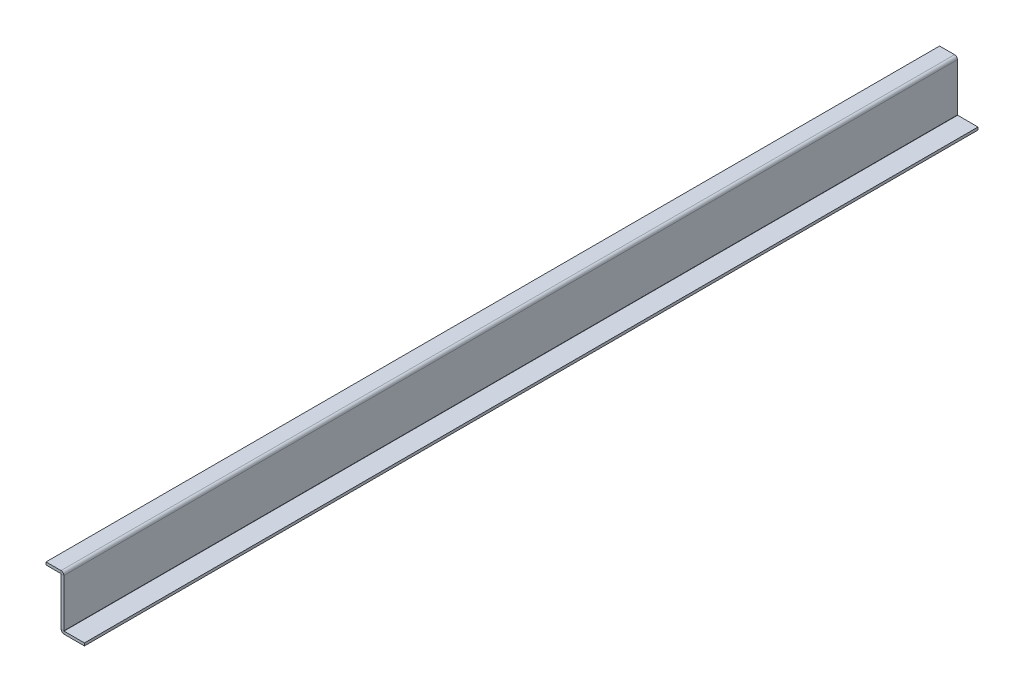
ISO-10303-21;
HEADER;
FILE_DESCRIPTION(('STEP AP214'),'2;1');
FILE_NAME('part.step','',(''),(''),'','','');
FILE_SCHEMA(('AUTOMOTIVE_DESIGN { 1 0 10303 214 1 1 1 1 }'));
ENDSEC;
DATA;
#1=APPLICATION_CONTEXT('core data for automotive mechanical design processes');
#2=APPLICATION_PROTOCOL_DEFINITION('international standard','automotive_design',2000,#1);
#3=PRODUCT_CONTEXT('',#1,'mechanical');
#4=PRODUCT('Part','Part','',(#3));
#5=PRODUCT_RELATED_PRODUCT_CATEGORY('part','',(#4));
#6=PRODUCT_DEFINITION_FORMATION('','',#4);
#7=PRODUCT_DEFINITION_CONTEXT('part definition',#1,'design');
#8=PRODUCT_DEFINITION('design','',#6,#7);
#9=PRODUCT_DEFINITION_SHAPE('','',#8);
#10=(LENGTH_UNIT() NAMED_UNIT(*) SI_UNIT(.MILLI.,.METRE.));
#11=(NAMED_UNIT(*) PLANE_ANGLE_UNIT() SI_UNIT($,.RADIAN.));
#12=(NAMED_UNIT(*) SI_UNIT($,.STERADIAN.) SOLID_ANGLE_UNIT());
#13=UNCERTAINTY_MEASURE_WITH_UNIT(LENGTH_MEASURE(1.E-05),#10,'distance_accuracy_value','');
#14=(GEOMETRIC_REPRESENTATION_CONTEXT(3) GLOBAL_UNCERTAINTY_ASSIGNED_CONTEXT((#13)) GLOBAL_UNIT_ASSIGNED_CONTEXT((#10,
#11,#12)) REPRESENTATION_CONTEXT('',''));
#15=CARTESIAN_POINT('',(0.,0.,0.));
#16=DIRECTION('',(0.,0.,1.));
#17=DIRECTION('',(1.,0.,0.));
#18=AXIS2_PLACEMENT_3D('',#15,#16,#17);
#19=CARTESIAN_POINT('',(-1.60000000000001,28.5,-500.));
#20=DIRECTION('',(0.,0.,-1.));
#21=DIRECTION('',(-1.,0.,0.));
#22=AXIS2_PLACEMENT_3D('',#19,#20,#21);
#23=PLANE('',#22);
#24=DIRECTION('',(0.,-1.,0.));
#25=VECTOR('',#24,1.);
#26=CARTESIAN_POINT('',(-1.60000000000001,28.5,-500.));
#27=LINE('',#26,#25);
#28=CARTESIAN_POINT('',(-1.60000000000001,28.5,-500.));
#29=VERTEX_POINT('',#28);
#30=CARTESIAN_POINT('',(-1.6,27.,-500.));
#31=VERTEX_POINT('',#30);
#32=EDGE_CURVE('E11',#29,#31,#27,.T.);
#33=ORIENTED_EDGE('',*,*,#32,.F.);
#34=CARTESIAN_POINT('',(-1.6,26.9,-500.));
#35=DIRECTION('',(0.,0.,1.));
#36=DIRECTION('',(1.,0.,0.));
#37=AXIS2_PLACEMENT_3D('',#34,#35,#36);
#38=CIRCLE('',#37,1.6);
#39=CARTESIAN_POINT('',(0.,26.9,-500.));
#40=VERTEX_POINT('',#39);
#41=EDGE_CURVE('E139',#29,#40,#38,.F.);
#42=ORIENTED_EDGE('',*,*,#41,.T.);
#43=DIRECTION('',(1.,0.,0.));
#44=VECTOR('',#43,1.);
#45=CARTESIAN_POINT('',(-1.5,26.9,-500.));
#46=LINE('',#45,#44);
#47=CARTESIAN_POINT('',(-1.5,26.9,-500.));
#48=VERTEX_POINT('',#47);
#49=EDGE_CURVE('E43',#48,#40,#46,.T.);
#50=ORIENTED_EDGE('',*,*,#49,.F.);
#51=CARTESIAN_POINT('',(-1.6,26.9,-500.));
#52=DIRECTION('',(0.,0.,1.));
#53=DIRECTION('',(1.,0.,0.));
#54=AXIS2_PLACEMENT_3D('',#51,#52,#53);
#55=CIRCLE('',#54,0.1);
#56=EDGE_CURVE('E136',#31,#48,#55,.F.);
#57=ORIENTED_EDGE('',*,*,#56,.F.);
#58=EDGE_LOOP('',(#33,#42,#50,#57));
#59=FACE_BOUND('',#58,.T.);
#60=ADVANCED_FACE('F35',(#59),#23,.T.);
#61=CARTESIAN_POINT('',(-1.5,26.9,-500.));
#62=DIRECTION('',(0.,0.,-1.));
#63=DIRECTION('',(-1.,0.,0.));
#64=AXIS2_PLACEMENT_3D('',#61,#62,#63);
#65=PLANE('',#64);
#66=DIRECTION('',(1.,0.,0.));
#67=VECTOR('',#66,1.);
#68=CARTESIAN_POINT('',(-10.,28.5,-500.));
#69=LINE('',#68,#67);
#70=CARTESIAN_POINT('',(-10.,28.5,-500.));
#71=VERTEX_POINT('',#70);
#72=EDGE_CURVE('E256',#71,#29,#69,.T.);
#73=ORIENTED_EDGE('',*,*,#72,.T.);
#74=ORIENTED_EDGE('',*,*,#32,.T.);
#75=DIRECTION('',(1.,0.,0.));
#76=VECTOR('',#75,1.);
#77=CARTESIAN_POINT('',(-10.,27.,-500.));
#78=LINE('',#77,#76);
#79=CARTESIAN_POINT('',(-10.,27.,-500.));
#80=VERTEX_POINT('',#79);
#81=EDGE_CURVE('E168',#80,#31,#78,.T.);
#82=ORIENTED_EDGE('',*,*,#81,.F.);
#83=DIRECTION('',(0.,1.,0.));
#84=VECTOR('',#83,1.);
#85=CARTESIAN_POINT('',(-10.,27.,-500.));
#86=LINE('',#85,#84);
#87=EDGE_CURVE('E170',#80,#71,#86,.T.);
#88=ORIENTED_EDGE('',*,*,#87,.T.);
#89=EDGE_LOOP('',(#73,#74,#82,#88));
#90=FACE_BOUND('',#89,.T.);
#91=ADVANCED_FACE('F267',(#90),#65,.T.);
#92=CARTESIAN_POINT('',(0.,26.9,0.));
#93=DIRECTION('',(0.,0.,1.));
#94=DIRECTION('',(1.,0.,0.));
#95=AXIS2_PLACEMENT_3D('',#92,#93,#94);
#96=PLANE('',#95);
#97=DIRECTION('',(-1.,0.,0.));
#98=VECTOR('',#97,1.);
#99=CARTESIAN_POINT('',(0.,26.9,0.));
#100=LINE('',#99,#98);
#101=CARTESIAN_POINT('',(0.,26.9,0.));
#102=VERTEX_POINT('',#101);
#103=CARTESIAN_POINT('',(-1.5,26.9,0.));
#104=VERTEX_POINT('',#103);
#105=EDGE_CURVE('E144',#102,#104,#100,.T.);
#106=ORIENTED_EDGE('',*,*,#105,.F.);
#107=CARTESIAN_POINT('',(-1.6,26.9,0.));
#108=DIRECTION('',(0.,0.,1.));
#109=DIRECTION('',(1.,0.,0.));
#110=AXIS2_PLACEMENT_3D('',#107,#108,#109);
#111=CIRCLE('',#110,1.6);
#112=CARTESIAN_POINT('',(-1.60000000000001,28.5,0.));
#113=VERTEX_POINT('',#112);
#114=EDGE_CURVE('E190',#113,#102,#111,.F.);
#115=ORIENTED_EDGE('',*,*,#114,.F.);
#116=DIRECTION('',(0.,1.,0.));
#117=VECTOR('',#116,1.);
#118=CARTESIAN_POINT('',(-1.6,27.,0.));
#119=LINE('',#118,#117);
#120=CARTESIAN_POINT('',(-1.6,27.,0.));
#121=VERTEX_POINT('',#120);
#122=EDGE_CURVE('E236',#121,#113,#119,.T.);
#123=ORIENTED_EDGE('',*,*,#122,.F.);
#124=CARTESIAN_POINT('',(-1.6,26.9,0.));
#125=DIRECTION('',(0.,0.,1.));
#126=DIRECTION('',(1.,0.,0.));
#127=AXIS2_PLACEMENT_3D('',#124,#125,#126);
#128=CIRCLE('',#127,0.1);
#129=EDGE_CURVE('E201',#121,#104,#128,.F.);
#130=ORIENTED_EDGE('',*,*,#129,.T.);
#131=EDGE_LOOP('',(#106,#115,#123,#130));
#132=FACE_BOUND('',#131,.T.);
#133=ADVANCED_FACE('F244',(#132),#96,.T.);
#134=CARTESIAN_POINT('',(-1.6,27.,0.));
#135=DIRECTION('',(0.,0.,1.));
#136=DIRECTION('',(1.,0.,0.));
#137=AXIS2_PLACEMENT_3D('',#134,#135,#136);
#138=PLANE('',#137);
#139=DIRECTION('',(0.,-1.,0.));
#140=VECTOR('',#139,1.);
#141=CARTESIAN_POINT('',(0.,28.5,0.));
#142=LINE('',#141,#140);
#143=CARTESIAN_POINT('',(0.,0.100000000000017,0.));
#144=VERTEX_POINT('',#143);
#145=EDGE_CURVE('E187',#102,#144,#142,.T.);
#146=ORIENTED_EDGE('',*,*,#145,.F.);
#147=ORIENTED_EDGE('',*,*,#105,.T.);
#148=DIRECTION('',(0.,-1.,0.));
#149=VECTOR('',#148,1.);
#150=CARTESIAN_POINT('',(-1.5,28.5,0.));
#151=LINE('',#150,#149);
#152=CARTESIAN_POINT('',(-1.5,0.100000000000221,0.));
#153=VERTEX_POINT('',#152);
#154=EDGE_CURVE('E153',#104,#153,#151,.T.);
#155=ORIENTED_EDGE('',*,*,#154,.T.);
#156=DIRECTION('',(1.,-1.36031232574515E-13,0.));
#157=VECTOR('',#156,1.);
#158=CARTESIAN_POINT('',(-1.5,0.100000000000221,0.));
#159=LINE('',#158,#157);
#160=EDGE_CURVE('E92',#153,#144,#159,.T.);
#161=ORIENTED_EDGE('',*,*,#160,.T.);
#162=EDGE_LOOP('',(#146,#147,#155,#161));
#163=FACE_BOUND('',#162,.T.);
#164=ADVANCED_FACE('F240',(#163),#138,.T.);
#165=CARTESIAN_POINT('',(0.,0.100000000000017,-500.));
#166=DIRECTION('',(0.,0.,-1.));
#167=DIRECTION('',(-1.,0.,0.));
#168=AXIS2_PLACEMENT_3D('',#165,#166,#167);
#169=PLANE('',#168);
#170=DIRECTION('',(-1.,1.36031232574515E-13,0.));
#171=VECTOR('',#170,1.);
#172=CARTESIAN_POINT('',(0.,0.100000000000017,-500.));
#173=LINE('',#172,#171);
#174=CARTESIAN_POINT('',(0.,0.100000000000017,-500.));
#175=VERTEX_POINT('',#174);
#176=CARTESIAN_POINT('',(-1.5,0.100000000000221,-500.));
#177=VERTEX_POINT('',#176);
#178=EDGE_CURVE('E161',#175,#177,#173,.T.);
#179=ORIENTED_EDGE('',*,*,#178,.F.);
#180=CARTESIAN_POINT('',(0.1,0.100000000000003,-500.));
#181=DIRECTION('',(0.,0.,-1.));
#182=DIRECTION('',(-1.,0.,0.));
#183=AXIS2_PLACEMENT_3D('',#180,#181,#182);
#184=CIRCLE('',#183,0.1);
#185=CARTESIAN_POINT('',(0.1,0.,-500.));
#186=VERTEX_POINT('',#185);
#187=EDGE_CURVE('E254',#175,#186,#184,.F.);
#188=ORIENTED_EDGE('',*,*,#187,.T.);
#189=DIRECTION('',(0.,1.,0.));
#190=VECTOR('',#189,1.);
#191=CARTESIAN_POINT('',(0.1,-1.5,-500.));
#192=LINE('',#191,#190);
#193=CARTESIAN_POINT('',(0.1,-1.5,-500.));
#194=VERTEX_POINT('',#193);
#195=EDGE_CURVE('E51',#194,#186,#192,.T.);
#196=ORIENTED_EDGE('',*,*,#195,.F.);
#197=CARTESIAN_POINT('',(0.1,0.100000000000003,-500.));
#198=DIRECTION('',(0.,0.,1.));
#199=DIRECTION('',(1.,0.,0.));
#200=AXIS2_PLACEMENT_3D('',#197,#198,#199);
#201=CIRCLE('',#200,1.6);
#202=EDGE_CURVE('E163',#177,#194,#201,.T.);
#203=ORIENTED_EDGE('',*,*,#202,.F.);
#204=EDGE_LOOP('',(#179,#188,#196,#203));
#205=FACE_BOUND('',#204,.T.);
#206=ADVANCED_FACE('F299',(#205),#169,.T.);
#207=CARTESIAN_POINT('',(0.1,-1.5,-500.));
#208=DIRECTION('',(0.,0.,-1.));
#209=DIRECTION('',(-1.,0.,0.));
#210=AXIS2_PLACEMENT_3D('',#207,#208,#209);
#211=PLANE('',#210);
#212=DIRECTION('',(0.,-1.,0.));
#213=VECTOR('',#212,1.);
#214=CARTESIAN_POINT('',(0.,28.5,-500.));
#215=LINE('',#214,#213);
#216=EDGE_CURVE('E252',#40,#175,#215,.T.);
#217=ORIENTED_EDGE('',*,*,#216,.T.);
#218=ORIENTED_EDGE('',*,*,#178,.T.);
#219=DIRECTION('',(0.,-1.,0.));
#220=VECTOR('',#219,1.);
#221=CARTESIAN_POINT('',(-1.5,28.5,-500.));
#222=LINE('',#221,#220);
#223=EDGE_CURVE('E151',#48,#177,#222,.T.);
#224=ORIENTED_EDGE('',*,*,#223,.F.);
#225=ORIENTED_EDGE('',*,*,#49,.T.);
#226=EDGE_LOOP('',(#217,#218,#224,#225));
#227=FACE_BOUND('',#226,.T.);
#228=ADVANCED_FACE('F160',(#227),#211,.T.);
#229=CARTESIAN_POINT('',(0.1,0.,0.));
#230=DIRECTION('',(0.,0.,1.));
#231=DIRECTION('',(1.,0.,0.));
#232=AXIS2_PLACEMENT_3D('',#229,#230,#231);
#233=PLANE('',#232);
#234=DIRECTION('',(0.,-1.,0.));
#235=VECTOR('',#234,1.);
#236=CARTESIAN_POINT('',(0.1,0.,0.));
#237=LINE('',#236,#235);
#238=CARTESIAN_POINT('',(0.1,0.,0.));
#239=VERTEX_POINT('',#238);
#240=CARTESIAN_POINT('',(0.1,-1.5,0.));
#241=VERTEX_POINT('',#240);
#242=EDGE_CURVE('E99',#239,#241,#237,.T.);
#243=ORIENTED_EDGE('',*,*,#242,.F.);
#244=CARTESIAN_POINT('',(0.1,0.100000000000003,0.));
#245=DIRECTION('',(0.,0.,-1.));
#246=DIRECTION('',(-1.,0.,0.));
#247=AXIS2_PLACEMENT_3D('',#244,#245,#246);
#248=CIRCLE('',#247,0.1);
#249=EDGE_CURVE('E184',#144,#239,#248,.F.);
#250=ORIENTED_EDGE('',*,*,#249,.F.);
#251=ORIENTED_EDGE('',*,*,#160,.F.);
#252=CARTESIAN_POINT('',(0.1,0.100000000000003,0.));
#253=DIRECTION('',(0.,0.,1.));
#254=DIRECTION('',(1.,0.,0.));
#255=AXIS2_PLACEMENT_3D('',#252,#253,#254);
#256=CIRCLE('',#255,1.6);
#257=EDGE_CURVE('E204',#153,#241,#256,.T.);
#258=ORIENTED_EDGE('',*,*,#257,.T.);
#259=EDGE_LOOP('',(#243,#250,#251,#258));
#260=FACE_BOUND('',#259,.T.);
#261=ADVANCED_FACE('F304',(#260),#233,.T.);
#262=CARTESIAN_POINT('',(-1.5,0.100000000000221,0.));
#263=DIRECTION('',(0.,0.,1.));
#264=DIRECTION('',(1.,0.,0.));
#265=AXIS2_PLACEMENT_3D('',#262,#263,#264);
#266=PLANE('',#265);
#267=DIRECTION('',(1.,0.,0.));
#268=VECTOR('',#267,1.);
#269=CARTESIAN_POINT('',(0.,0.,0.));
#270=LINE('',#269,#268);
#271=CARTESIAN_POINT('',(11.5,0.,0.));
#272=VERTEX_POINT('',#271);
#273=EDGE_CURVE('E182',#239,#272,#270,.T.);
#274=ORIENTED_EDGE('',*,*,#273,.F.);
#275=ORIENTED_EDGE('',*,*,#242,.T.);
#276=DIRECTION('',(1.,0.,0.));
#277=VECTOR('',#276,1.);
#278=CARTESIAN_POINT('',(0.,-1.5,0.));
#279=LINE('',#278,#277);
#280=CARTESIAN_POINT('',(11.5,-1.5,0.));
#281=VERTEX_POINT('',#280);
#282=EDGE_CURVE('E177',#241,#281,#279,.T.);
#283=ORIENTED_EDGE('',*,*,#282,.T.);
#284=DIRECTION('',(0.,-1.,0.));
#285=VECTOR('',#284,1.);
#286=CARTESIAN_POINT('',(11.5,0.,0.));
#287=LINE('',#286,#285);
#288=EDGE_CURVE('E179',#272,#281,#287,.T.);
#289=ORIENTED_EDGE('',*,*,#288,.F.);
#290=EDGE_LOOP('',(#274,#275,#283,#289));
#291=FACE_BOUND('',#290,.T.);
#292=ADVANCED_FACE('F307',(#291),#266,.T.);
#293=CARTESIAN_POINT('',(0.,-1.5,-500.));
#294=DIRECTION('',(0.,-1.,0.));
#295=DIRECTION('',(0.,0.,-1.));
#296=AXIS2_PLACEMENT_3D('',#293,#294,#295);
#297=PLANE('',#296);
#298=ORIENTED_EDGE('',*,*,#282,.F.);
#299=DIRECTION('',(0.,0.,1.));
#300=VECTOR('',#299,1.);
#301=CARTESIAN_POINT('',(0.1,-1.5,-500.));
#302=LINE('',#301,#300);
#303=EDGE_CURVE('E207',#194,#241,#302,.T.);
#304=ORIENTED_EDGE('',*,*,#303,.F.);
#305=DIRECTION('',(1.,0.,0.));
#306=VECTOR('',#305,1.);
#307=CARTESIAN_POINT('',(0.,-1.5,-500.));
#308=LINE('',#307,#306);
#309=CARTESIAN_POINT('',(11.5,-1.5,-500.));
#310=VERTEX_POINT('',#309);
#311=EDGE_CURVE('E206',#194,#310,#308,.T.);
#312=ORIENTED_EDGE('',*,*,#311,.T.);
#313=DIRECTION('',(0.,0.,1.));
#314=VECTOR('',#313,1.);
#315=CARTESIAN_POINT('',(11.5,-1.5,-500.));
#316=LINE('',#315,#314);
#317=EDGE_CURVE('E176',#310,#281,#316,.T.);
#318=ORIENTED_EDGE('',*,*,#317,.T.);
#319=EDGE_LOOP('',(#298,#304,#312,#318));
#320=FACE_BOUND('',#319,.T.);
#321=ADVANCED_FACE('F310',(#320),#297,.T.);
#322=CARTESIAN_POINT('',(0.1,0.100000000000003,-500.));
#323=DIRECTION('',(0.,0.,1.));
#324=DIRECTION('',(1.,0.,0.));
#325=AXIS2_PLACEMENT_3D('',#322,#323,#324);
#326=CYLINDRICAL_SURFACE('',#325,1.6);
#327=ORIENTED_EDGE('',*,*,#257,.F.);
#328=DIRECTION('',(0.,0.,1.));
#329=VECTOR('',#328,1.);
#330=CARTESIAN_POINT('',(-1.5,0.100000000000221,-500.));
#331=LINE('',#330,#329);
#332=EDGE_CURVE('E157',#177,#153,#331,.T.);
#333=ORIENTED_EDGE('',*,*,#332,.F.);
#334=ORIENTED_EDGE('',*,*,#202,.T.);
#335=ORIENTED_EDGE('',*,*,#303,.T.);
#336=EDGE_LOOP('',(#327,#333,#334,#335));
#337=FACE_BOUND('',#336,.T.);
#338=ADVANCED_FACE('F313',(#337),#326,.T.);
#339=CARTESIAN_POINT('',(-1.5,28.5,-500.));
#340=DIRECTION('',(-1.,0.,0.));
#341=DIRECTION('',(0.,-1.,0.));
#342=AXIS2_PLACEMENT_3D('',#339,#340,#341);
#343=PLANE('',#342);
#344=ORIENTED_EDGE('',*,*,#154,.F.);
#345=DIRECTION('',(0.,0.,1.));
#346=VECTOR('',#345,1.);
#347=CARTESIAN_POINT('',(-1.5,26.9,-500.));
#348=LINE('',#347,#346);
#349=EDGE_CURVE('E149',#48,#104,#348,.T.);
#350=ORIENTED_EDGE('',*,*,#349,.F.);
#351=ORIENTED_EDGE('',*,*,#223,.T.);
#352=ORIENTED_EDGE('',*,*,#332,.T.);
#353=EDGE_LOOP('',(#344,#350,#351,#352));
#354=FACE_BOUND('',#353,.T.);
#355=ADVANCED_FACE('F150',(#354),#343,.T.);
#356=CARTESIAN_POINT('',(-1.6,26.9,-500.));
#357=DIRECTION('',(0.,0.,1.));
#358=DIRECTION('',(1.,0.,0.));
#359=AXIS2_PLACEMENT_3D('',#356,#357,#358);
#360=CYLINDRICAL_SURFACE('',#359,0.1);
#361=ORIENTED_EDGE('',*,*,#129,.F.);
#362=DIRECTION('',(0.,0.,1.));
#363=VECTOR('',#362,1.);
#364=CARTESIAN_POINT('',(-1.6,27.,-500.));
#365=LINE('',#364,#363);
#366=EDGE_CURVE('E158',#31,#121,#365,.T.);
#367=ORIENTED_EDGE('',*,*,#366,.F.);
#368=ORIENTED_EDGE('',*,*,#56,.T.);
#369=ORIENTED_EDGE('',*,*,#349,.T.);
#370=EDGE_LOOP('',(#361,#367,#368,#369));
#371=FACE_BOUND('',#370,.T.);
#372=ADVANCED_FACE('F166',(#371),#360,.F.);
#373=CARTESIAN_POINT('',(-10.,27.,-500.));
#374=DIRECTION('',(0.,-1.,0.));
#375=DIRECTION('',(0.,0.,-1.));
#376=AXIS2_PLACEMENT_3D('',#373,#374,#375);
#377=PLANE('',#376);
#378=DIRECTION('',(1.,0.,0.));
#379=VECTOR('',#378,1.);
#380=CARTESIAN_POINT('',(-10.,27.,0.));
#381=LINE('',#380,#379);
#382=CARTESIAN_POINT('',(-10.,27.,0.));
#383=VERTEX_POINT('',#382);
#384=EDGE_CURVE('E198',#383,#121,#381,.T.);
#385=ORIENTED_EDGE('',*,*,#384,.F.);
#386=DIRECTION('',(0.,0.,1.));
#387=VECTOR('',#386,1.);
#388=CARTESIAN_POINT('',(-10.,27.,-500.));
#389=LINE('',#388,#387);
#390=EDGE_CURVE('E211',#80,#383,#389,.T.);
#391=ORIENTED_EDGE('',*,*,#390,.F.);
#392=ORIENTED_EDGE('',*,*,#81,.T.);
#393=ORIENTED_EDGE('',*,*,#366,.T.);
#394=EDGE_LOOP('',(#385,#391,#392,#393));
#395=FACE_BOUND('',#394,.T.);
#396=ADVANCED_FACE('F279',(#395),#377,.T.);
#397=CARTESIAN_POINT('',(-10.,27.,-500.));
#398=DIRECTION('',(1.,0.,0.));
#399=DIRECTION('',(0.,0.,-1.));
#400=AXIS2_PLACEMENT_3D('',#397,#398,#399);
#401=PLANE('',#400);
#402=DIRECTION('',(0.,1.,0.));
#403=VECTOR('',#402,1.);
#404=CARTESIAN_POINT('',(-10.,27.,0.));
#405=LINE('',#404,#403);
#406=CARTESIAN_POINT('',(-10.,28.5,0.));
#407=VERTEX_POINT('',#406);
#408=EDGE_CURVE('E196',#383,#407,#405,.T.);
#409=ORIENTED_EDGE('',*,*,#408,.T.);
#410=DIRECTION('',(0.,0.,1.));
#411=VECTOR('',#410,1.);
#412=CARTESIAN_POINT('',(-10.,28.5,-500.));
#413=LINE('',#412,#411);
#414=EDGE_CURVE('E213',#71,#407,#413,.T.);
#415=ORIENTED_EDGE('',*,*,#414,.F.);
#416=ORIENTED_EDGE('',*,*,#87,.F.);
#417=ORIENTED_EDGE('',*,*,#390,.T.);
#418=EDGE_LOOP('',(#409,#415,#416,#417));
#419=FACE_BOUND('',#418,.T.);
#420=ADVANCED_FACE('F270',(#419),#401,.F.);
#421=CARTESIAN_POINT('',(-10.,28.5,-500.));
#422=DIRECTION('',(0.,-1.,0.));
#423=DIRECTION('',(0.,0.,-1.));
#424=AXIS2_PLACEMENT_3D('',#421,#422,#423);
#425=PLANE('',#424);
#426=DIRECTION('',(1.,0.,0.));
#427=VECTOR('',#426,1.);
#428=CARTESIAN_POINT('',(-10.,28.5,0.));
#429=LINE('',#428,#427);
#430=EDGE_CURVE('E193',#407,#113,#429,.T.);
#431=ORIENTED_EDGE('',*,*,#430,.T.);
#432=DIRECTION('',(0.,0.,1.));
#433=VECTOR('',#432,1.);
#434=CARTESIAN_POINT('',(-1.60000000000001,28.5,-500.));
#435=LINE('',#434,#433);
#436=EDGE_CURVE('E216',#29,#113,#435,.T.);
#437=ORIENTED_EDGE('',*,*,#436,.F.);
#438=ORIENTED_EDGE('',*,*,#72,.F.);
#439=ORIENTED_EDGE('',*,*,#414,.T.);
#440=EDGE_LOOP('',(#431,#437,#438,#439));
#441=FACE_BOUND('',#440,.T.);
#442=ADVANCED_FACE('F274',(#441),#425,.F.);
#443=CARTESIAN_POINT('',(-1.6,26.9,-500.));
#444=DIRECTION('',(0.,0.,1.));
#445=DIRECTION('',(1.,0.,0.));
#446=AXIS2_PLACEMENT_3D('',#443,#444,#445);
#447=CYLINDRICAL_SURFACE('',#446,1.6);
#448=ORIENTED_EDGE('',*,*,#114,.T.);
#449=DIRECTION('',(0.,0.,1.));
#450=VECTOR('',#449,1.);
#451=CARTESIAN_POINT('',(0.,26.9,-500.));
#452=LINE('',#451,#450);
#453=EDGE_CURVE('E219',#40,#102,#452,.T.);
#454=ORIENTED_EDGE('',*,*,#453,.F.);
#455=ORIENTED_EDGE('',*,*,#41,.F.);
#456=ORIENTED_EDGE('',*,*,#436,.T.);
#457=EDGE_LOOP('',(#448,#454,#455,#456));
#458=FACE_BOUND('',#457,.T.);
#459=ADVANCED_FACE('F246',(#458),#447,.T.);
#460=CARTESIAN_POINT('',(0.,28.5,-500.));
#461=DIRECTION('',(-1.,0.,0.));
#462=DIRECTION('',(0.,-1.,0.));
#463=AXIS2_PLACEMENT_3D('',#460,#461,#462);
#464=PLANE('',#463);
#465=ORIENTED_EDGE('',*,*,#145,.T.);
#466=DIRECTION('',(0.,0.,1.));
#467=VECTOR('',#466,1.);
#468=CARTESIAN_POINT('',(0.,0.100000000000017,-500.));
#469=LINE('',#468,#467);
#470=EDGE_CURVE('E222',#175,#144,#469,.T.);
#471=ORIENTED_EDGE('',*,*,#470,.F.);
#472=ORIENTED_EDGE('',*,*,#216,.F.);
#473=ORIENTED_EDGE('',*,*,#453,.T.);
#474=EDGE_LOOP('',(#465,#471,#472,#473));
#475=FACE_BOUND('',#474,.T.);
#476=ADVANCED_FACE('F250',(#475),#464,.F.);
#477=CARTESIAN_POINT('',(0.1,0.100000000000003,-500.));
#478=DIRECTION('',(0.,0.,1.));
#479=DIRECTION('',(1.,0.,0.));
#480=AXIS2_PLACEMENT_3D('',#477,#478,#479);
#481=CYLINDRICAL_SURFACE('',#480,0.1);
#482=ORIENTED_EDGE('',*,*,#249,.T.);
#483=DIRECTION('',(0.,0.,1.));
#484=VECTOR('',#483,1.);
#485=CARTESIAN_POINT('',(0.1,0.,-500.));
#486=LINE('',#485,#484);
#487=EDGE_CURVE('E225',#186,#239,#486,.T.);
#488=ORIENTED_EDGE('',*,*,#487,.F.);
#489=ORIENTED_EDGE('',*,*,#187,.F.);
#490=ORIENTED_EDGE('',*,*,#470,.T.);
#491=EDGE_LOOP('',(#482,#488,#489,#490));
#492=FACE_BOUND('',#491,.T.);
#493=ADVANCED_FACE('F323',(#492),#481,.F.);
#494=CARTESIAN_POINT('',(0.,0.,-500.));
#495=DIRECTION('',(0.,-1.,0.));
#496=DIRECTION('',(0.,0.,-1.));
#497=AXIS2_PLACEMENT_3D('',#494,#495,#496);
#498=PLANE('',#497);
#499=ORIENTED_EDGE('',*,*,#273,.T.);
#500=DIRECTION('',(0.,0.,1.));
#501=VECTOR('',#500,1.);
#502=CARTESIAN_POINT('',(11.5,0.,-500.));
#503=LINE('',#502,#501);
#504=CARTESIAN_POINT('',(11.5,0.,-500.));
#505=VERTEX_POINT('',#504);
#506=EDGE_CURVE('E228',#505,#272,#503,.T.);
#507=ORIENTED_EDGE('',*,*,#506,.F.);
#508=DIRECTION('',(1.,0.,0.));
#509=VECTOR('',#508,1.);
#510=CARTESIAN_POINT('',(0.,0.,-500.));
#511=LINE('',#510,#509);
#512=EDGE_CURVE('E258',#186,#505,#511,.T.);
#513=ORIENTED_EDGE('',*,*,#512,.F.);
#514=ORIENTED_EDGE('',*,*,#487,.T.);
#515=EDGE_LOOP('',(#499,#507,#513,#514));
#516=FACE_BOUND('',#515,.T.);
#517=ADVANCED_FACE('F319',(#516),#498,.F.);
#518=CARTESIAN_POINT('',(11.5,0.,-500.));
#519=DIRECTION('',(-1.,0.,0.));
#520=DIRECTION('',(0.,0.,1.));
#521=AXIS2_PLACEMENT_3D('',#518,#519,#520);
#522=PLANE('',#521);
#523=ORIENTED_EDGE('',*,*,#288,.T.);
#524=ORIENTED_EDGE('',*,*,#317,.F.);
#525=DIRECTION('',(0.,-1.,0.));
#526=VECTOR('',#525,1.);
#527=CARTESIAN_POINT('',(11.5,0.,-500.));
#528=LINE('',#527,#526);
#529=EDGE_CURVE('E108',#505,#310,#528,.T.);
#530=ORIENTED_EDGE('',*,*,#529,.F.);
#531=ORIENTED_EDGE('',*,*,#506,.T.);
#532=EDGE_LOOP('',(#523,#524,#530,#531));
#533=FACE_BOUND('',#532,.T.);
#534=ADVANCED_FACE('F315',(#533),#522,.F.);
#535=CARTESIAN_POINT('',(0.1,0.100000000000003,-500.));
#536=DIRECTION('',(0.,0.,-1.));
#537=DIRECTION('',(-1.,0.,0.));
#538=AXIS2_PLACEMENT_3D('',#535,#536,#537);
#539=PLANE('',#538);
#540=ORIENTED_EDGE('',*,*,#311,.F.);
#541=ORIENTED_EDGE('',*,*,#195,.T.);
#542=ORIENTED_EDGE('',*,*,#512,.T.);
#543=ORIENTED_EDGE('',*,*,#529,.T.);
#544=EDGE_LOOP('',(#540,#541,#542,#543));
#545=FACE_BOUND('',#544,.T.);
#546=ADVANCED_FACE('F318',(#545),#539,.T.);
#547=CARTESIAN_POINT('',(0.1,0.100000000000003,0.));
#548=DIRECTION('',(0.,0.,-1.));
#549=DIRECTION('',(-1.,0.,0.));
#550=AXIS2_PLACEMENT_3D('',#547,#548,#549);
#551=PLANE('',#550);
#552=ORIENTED_EDGE('',*,*,#384,.T.);
#553=ORIENTED_EDGE('',*,*,#122,.T.);
#554=ORIENTED_EDGE('',*,*,#430,.F.);
#555=ORIENTED_EDGE('',*,*,#408,.F.);
#556=EDGE_LOOP('',(#552,#553,#554,#555));
#557=FACE_BOUND('',#556,.T.);
#558=ADVANCED_FACE('F276',(#557),#551,.F.);
#559=CLOSED_SHELL('',(#60,#91,#133,#164,#206,#228,#261,#292,#321,#338,#355,#372,#396,#420,#442,
#459,#476,#493,#517,#534,#546,#558));
#560=MANIFOLD_SOLID_BREP('B2',#559);
#561=ADVANCED_BREP_SHAPE_REPRESENTATION('',(#18,#560),#14);
#562=SHAPE_DEFINITION_REPRESENTATION(#9,#561);
ENDSEC;
END-ISO-10303-21;
